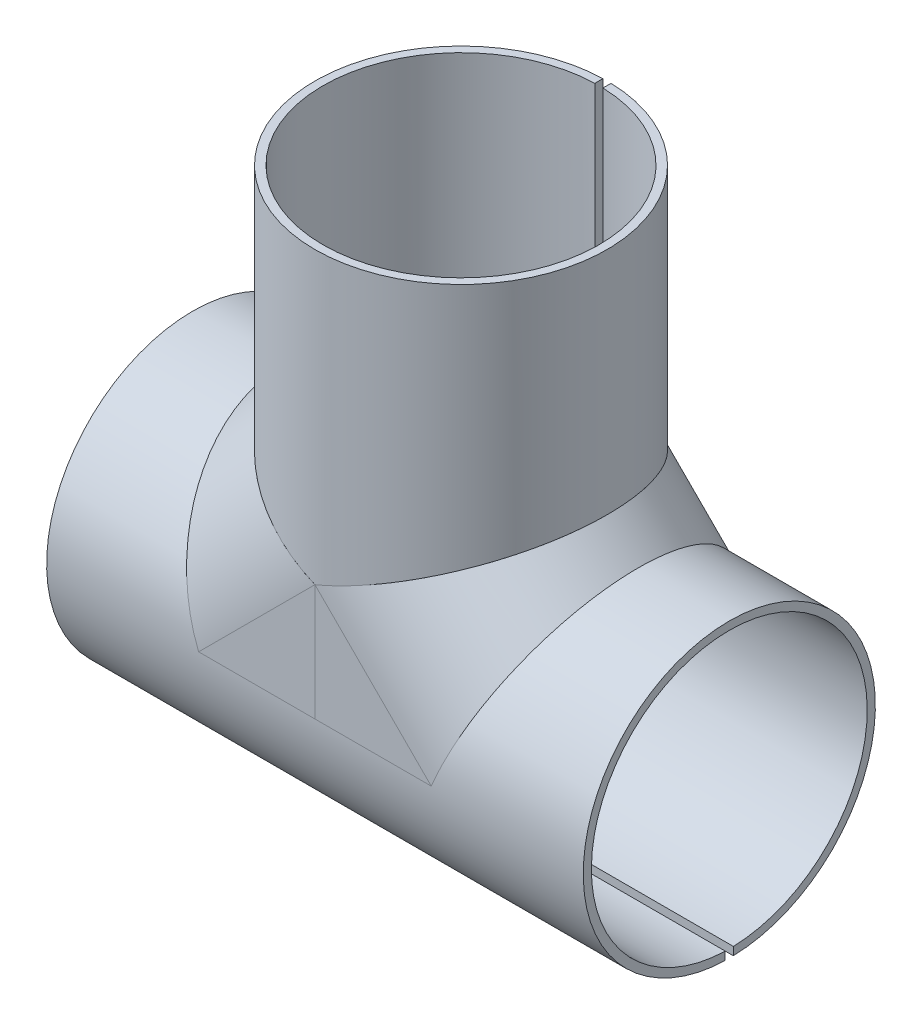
ISO-10303-21;
HEADER;
FILE_DESCRIPTION(('STEP AP214'),'2;1');
FILE_NAME('part.step','',(''),(''),'','','');
FILE_SCHEMA(('AUTOMOTIVE_DESIGN { 1 0 10303 214 1 1 1 1 }'));
ENDSEC;
DATA;
#1=APPLICATION_CONTEXT('core data for automotive mechanical design processes');
#2=APPLICATION_PROTOCOL_DEFINITION('international standard','automotive_design',2000,#1);
#3=PRODUCT_CONTEXT('',#1,'mechanical');
#4=PRODUCT('Part','Part','',(#3));
#5=PRODUCT_RELATED_PRODUCT_CATEGORY('part','',(#4));
#6=PRODUCT_DEFINITION_FORMATION('','',#4);
#7=PRODUCT_DEFINITION_CONTEXT('part definition',#1,'design');
#8=PRODUCT_DEFINITION('design','',#6,#7);
#9=PRODUCT_DEFINITION_SHAPE('','',#8);
#10=(LENGTH_UNIT() NAMED_UNIT(*) SI_UNIT(.MILLI.,.METRE.));
#11=(NAMED_UNIT(*) PLANE_ANGLE_UNIT() SI_UNIT($,.RADIAN.));
#12=(NAMED_UNIT(*) SI_UNIT($,.STERADIAN.) SOLID_ANGLE_UNIT());
#13=UNCERTAINTY_MEASURE_WITH_UNIT(LENGTH_MEASURE(1.E-05),#10,'distance_accuracy_value','');
#14=(GEOMETRIC_REPRESENTATION_CONTEXT(3) GLOBAL_UNCERTAINTY_ASSIGNED_CONTEXT((#13)) GLOBAL_UNIT_ASSIGNED_CONTEXT((#10,
#11,#12)) REPRESENTATION_CONTEXT('',''));
#15=CARTESIAN_POINT('',(0.,0.,0.));
#16=DIRECTION('',(0.,0.,1.));
#17=DIRECTION('',(1.,0.,0.));
#18=AXIS2_PLACEMENT_3D('',#15,#16,#17);
#19=CARTESIAN_POINT('',(-14.3061626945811,0.,0.));
#20=DIRECTION('',(0.707106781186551,0.707106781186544,0.));
#21=DIRECTION('',(-0.707106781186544,0.707106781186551,0.));
#22=AXIS2_PLACEMENT_3D('',#19,#20,#21);
#23=CYLINDRICAL_SURFACE('',#22,16.9630248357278);
#24=DIRECTION('',(0.707106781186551,0.707106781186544,0.));
#25=VECTOR('',#24,1.);
#26=CARTESIAN_POINT('',(-14.3061626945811,0.,16.9630248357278));
#27=LINE('',#26,#25);
#28=CARTESIAN_POINT('',(0.,14.3061626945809,16.9630248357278));
#29=VERTEX_POINT('',#28);
#30=CARTESIAN_POINT('',(-14.3061626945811,0.,16.9630248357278));
#31=VERTEX_POINT('',#30);
#32=EDGE_CURVE('E185',#29,#31,#27,.F.);
#33=ORIENTED_EDGE('',*,*,#32,.T.);
#34=CARTESIAN_POINT('',(-14.3061626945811,0.,0.));
#35=DIRECTION('',(-0.923879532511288,-0.382683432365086,0.));
#36=DIRECTION('',(-0.382683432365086,0.923879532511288,0.));
#37=AXIS2_PLACEMENT_3D('',#34,#35,#36);
#38=ELLIPSE('',#37,18.3606457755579,16.9630248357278);
#39=CARTESIAN_POINT('',(-14.3061626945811,0.,-16.9630248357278));
#40=VERTEX_POINT('',#39);
#41=EDGE_CURVE('E14',#31,#40,#38,.T.);
#42=ORIENTED_EDGE('',*,*,#41,.T.);
#43=DIRECTION('',(0.707106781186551,0.707106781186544,0.));
#44=VECTOR('',#43,1.);
#45=CARTESIAN_POINT('',(-14.3061626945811,0.,-16.9630248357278));
#46=LINE('',#45,#44);
#47=CARTESIAN_POINT('',(0.,14.3061626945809,-16.9630248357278));
#48=VERTEX_POINT('',#47);
#49=EDGE_CURVE('E83',#40,#48,#46,.T.);
#50=ORIENTED_EDGE('',*,*,#49,.T.);
#51=CARTESIAN_POINT('',(0.,14.3061626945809,0.));
#52=DIRECTION('',(0.382683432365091,0.923879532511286,0.));
#53=DIRECTION('',(0.923879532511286,-0.382683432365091,0.));
#54=AXIS2_PLACEMENT_3D('',#51,#52,#53);
#55=ELLIPSE('',#54,18.360645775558,16.9630248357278);
#56=EDGE_CURVE('E182',#48,#29,#55,.T.);
#57=ORIENTED_EDGE('',*,*,#56,.T.);
#58=EDGE_LOOP('',(#33,#42,#50,#57));
#59=FACE_BOUND('',#58,.T.);
#60=ADVANCED_FACE('F75',(#59),#23,.F.);
#61=CARTESIAN_POINT('',(-14.3061626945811,0.,-17.9630248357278));
#62=DIRECTION('',(-0.923879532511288,-0.382683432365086,0.));
#63=DIRECTION('',(0.382683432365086,-0.923879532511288,0.));
#64=AXIS2_PLACEMENT_3D('',#61,#62,#63);
#65=PLANE('',#64);
#66=CARTESIAN_POINT('',(-14.3061626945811,0.,0.));
#67=DIRECTION('',(-0.923879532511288,-0.382683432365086,0.));
#68=DIRECTION('',(-0.382683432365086,0.923879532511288,0.));
#69=AXIS2_PLACEMENT_3D('',#66,#67,#68);
#70=ELLIPSE('',#69,19.4430379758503,17.9630248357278);
#71=CARTESIAN_POINT('',(-14.3061626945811,0.,17.9630248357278));
#72=VERTEX_POINT('',#71);
#73=CARTESIAN_POINT('',(-14.3061626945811,0.,-17.9630248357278));
#74=VERTEX_POINT('',#73);
#75=EDGE_CURVE('E180',#72,#74,#70,.T.);
#76=ORIENTED_EDGE('',*,*,#75,.T.);
#77=DIRECTION('',(0.,0.,1.));
#78=VECTOR('',#77,1.);
#79=CARTESIAN_POINT('',(-14.3061626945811,0.,-17.9630248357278));
#80=LINE('',#79,#78);
#81=EDGE_CURVE('E98',#74,#40,#80,.T.);
#82=ORIENTED_EDGE('',*,*,#81,.T.);
#83=ORIENTED_EDGE('',*,*,#41,.F.);
#84=EDGE_CURVE('E176',#31,#72,#80,.T.);
#85=ORIENTED_EDGE('',*,*,#84,.T.);
#86=EDGE_LOOP('',(#76,#82,#83,#85));
#87=FACE_BOUND('',#86,.T.);
#88=ADVANCED_FACE('F189',(#87),#65,.T.);
#89=CARTESIAN_POINT('',(0.,14.3061626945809,-17.9630248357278));
#90=DIRECTION('',(0.382683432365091,0.923879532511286,0.));
#91=DIRECTION('',(-0.923879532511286,0.382683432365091,0.));
#92=AXIS2_PLACEMENT_3D('',#89,#90,#91);
#93=PLANE('',#92);
#94=CARTESIAN_POINT('',(0.,14.3061626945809,0.));
#95=DIRECTION('',(0.382683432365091,0.923879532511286,0.));
#96=DIRECTION('',(0.923879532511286,-0.382683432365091,0.));
#97=AXIS2_PLACEMENT_3D('',#94,#95,#96);
#98=ELLIPSE('',#97,19.4430379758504,17.9630248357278);
#99=CARTESIAN_POINT('',(0.,14.3061626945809,-17.9630248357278));
#100=VERTEX_POINT('',#99);
#101=CARTESIAN_POINT('',(0.,14.3061626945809,17.9630248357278));
#102=VERTEX_POINT('',#101);
#103=EDGE_CURVE('E175',#100,#102,#98,.T.);
#104=ORIENTED_EDGE('',*,*,#103,.T.);
#105=DIRECTION('',(0.,0.,1.));
#106=VECTOR('',#105,1.);
#107=CARTESIAN_POINT('',(0.,14.3061626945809,-17.9630248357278));
#108=LINE('',#107,#106);
#109=EDGE_CURVE('E173',#29,#102,#108,.T.);
#110=ORIENTED_EDGE('',*,*,#109,.F.);
#111=ORIENTED_EDGE('',*,*,#56,.F.);
#112=EDGE_CURVE('E150',#100,#48,#108,.T.);
#113=ORIENTED_EDGE('',*,*,#112,.F.);
#114=EDGE_LOOP('',(#104,#110,#111,#113));
#115=FACE_BOUND('',#114,.T.);
#116=ADVANCED_FACE('F203',(#115),#93,.T.);
#117=CARTESIAN_POINT('',(-14.3061626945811,0.,0.));
#118=DIRECTION('',(0.707106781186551,0.707106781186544,0.));
#119=DIRECTION('',(-0.707106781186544,0.707106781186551,0.));
#120=AXIS2_PLACEMENT_3D('',#117,#118,#119);
#121=CYLINDRICAL_SURFACE('',#120,17.9630248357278);
#122=ORIENTED_EDGE('',*,*,#75,.F.);
#123=DIRECTION('',(0.707106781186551,0.707106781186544,0.));
#124=VECTOR('',#123,1.);
#125=CARTESIAN_POINT('',(0.,14.3061626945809,17.9630248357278));
#126=LINE('',#125,#124);
#127=EDGE_CURVE('E167',#72,#102,#126,.T.);
#128=ORIENTED_EDGE('',*,*,#127,.T.);
#129=ORIENTED_EDGE('',*,*,#103,.F.);
#130=DIRECTION('',(0.707106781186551,0.707106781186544,0.));
#131=VECTOR('',#130,1.);
#132=CARTESIAN_POINT('',(0.,14.3061626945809,-17.9630248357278));
#133=LINE('',#132,#131);
#134=EDGE_CURVE('E170',#74,#100,#133,.T.);
#135=ORIENTED_EDGE('',*,*,#134,.F.);
#136=EDGE_LOOP('',(#122,#128,#129,#135));
#137=FACE_BOUND('',#136,.T.);
#138=ADVANCED_FACE('F77',(#137),#121,.T.);
#139=CARTESIAN_POINT('',(0.,0.,16.9630248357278));
#140=DIRECTION('',(1.,0.,0.));
#141=DIRECTION('',(0.,1.,0.));
#142=AXIS2_PLACEMENT_3D('',#139,#140,#141);
#143=PLANE('',#142);
#144=DIRECTION('',(0.,1.,0.));
#145=VECTOR('',#144,1.);
#146=CARTESIAN_POINT('',(0.,0.,17.9630248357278));
#147=LINE('',#146,#145);
#148=CARTESIAN_POINT('',(0.,0.,17.9630248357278));
#149=VERTEX_POINT('',#148);
#150=EDGE_CURVE('E90',#149,#102,#147,.T.);
#151=ORIENTED_EDGE('',*,*,#150,.F.);
#152=DIRECTION('',(0.,0.,1.));
#153=VECTOR('',#152,1.);
#154=CARTESIAN_POINT('',(0.,0.,16.9630248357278));
#155=LINE('',#154,#153);
#156=CARTESIAN_POINT('',(0.,0.,16.9630248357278));
#157=VERTEX_POINT('',#156);
#158=EDGE_CURVE('E163',#157,#149,#155,.T.);
#159=ORIENTED_EDGE('',*,*,#158,.F.);
#160=DIRECTION('',(0.,1.,0.));
#161=VECTOR('',#160,1.);
#162=CARTESIAN_POINT('',(0.,0.,16.9630248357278));
#163=LINE('',#162,#161);
#164=EDGE_CURVE('E156',#157,#29,#163,.T.);
#165=ORIENTED_EDGE('',*,*,#164,.T.);
#166=ORIENTED_EDGE('',*,*,#109,.T.);
#167=EDGE_LOOP('',(#151,#159,#165,#166));
#168=FACE_BOUND('',#167,.T.);
#169=ADVANCED_FACE('F201',(#168),#143,.T.);
#170=CARTESIAN_POINT('',(-14.3061626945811,0.,16.9630248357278));
#171=DIRECTION('',(0.,-1.,0.));
#172=DIRECTION('',(0.,0.,-1.));
#173=AXIS2_PLACEMENT_3D('',#170,#171,#172);
#174=PLANE('',#173);
#175=DIRECTION('',(1.,0.,0.));
#176=VECTOR('',#175,1.);
#177=CARTESIAN_POINT('',(-14.3061626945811,0.,17.9630248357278));
#178=LINE('',#177,#176);
#179=EDGE_CURVE('E160',#72,#149,#178,.T.);
#180=ORIENTED_EDGE('',*,*,#179,.F.);
#181=ORIENTED_EDGE('',*,*,#84,.F.);
#182=DIRECTION('',(1.,0.,0.));
#183=VECTOR('',#182,1.);
#184=CARTESIAN_POINT('',(-14.3061626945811,0.,16.9630248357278));
#185=LINE('',#184,#183);
#186=EDGE_CURVE('E159',#31,#157,#185,.T.);
#187=ORIENTED_EDGE('',*,*,#186,.T.);
#188=ORIENTED_EDGE('',*,*,#158,.T.);
#189=EDGE_LOOP('',(#180,#181,#187,#188));
#190=FACE_BOUND('',#189,.T.);
#191=ADVANCED_FACE('F195',(#190),#174,.T.);
#192=CARTESIAN_POINT('',(0.,0.,16.9630248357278));
#193=DIRECTION('',(0.,0.,-1.));
#194=DIRECTION('',(-1.,0.,0.));
#195=AXIS2_PLACEMENT_3D('',#192,#193,#194);
#196=PLANE('',#195);
#197=ORIENTED_EDGE('',*,*,#164,.F.);
#198=ORIENTED_EDGE('',*,*,#186,.F.);
#199=ORIENTED_EDGE('',*,*,#32,.F.);
#200=EDGE_LOOP('',(#197,#198,#199));
#201=FACE_BOUND('',#200,.T.);
#202=ADVANCED_FACE('F198',(#201),#196,.T.);
#203=CARTESIAN_POINT('',(0.,0.,17.9630248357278));
#204=DIRECTION('',(0.,0.,-1.));
#205=DIRECTION('',(-1.,0.,0.));
#206=AXIS2_PLACEMENT_3D('',#203,#204,#205);
#207=PLANE('',#206);
#208=ORIENTED_EDGE('',*,*,#150,.T.);
#209=ORIENTED_EDGE('',*,*,#127,.F.);
#210=ORIENTED_EDGE('',*,*,#179,.T.);
#211=EDGE_LOOP('',(#208,#209,#210));
#212=FACE_BOUND('',#211,.T.);
#213=ADVANCED_FACE('F205',(#212),#207,.F.);
#214=CARTESIAN_POINT('',(0.,0.,-16.9630248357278));
#215=DIRECTION('',(-1.,0.,0.));
#216=DIRECTION('',(0.,-1.,0.));
#217=AXIS2_PLACEMENT_3D('',#214,#215,#216);
#218=PLANE('',#217);
#219=DIRECTION('',(0.,1.,0.));
#220=VECTOR('',#219,1.);
#221=CARTESIAN_POINT('',(0.,0.,-17.9630248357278));
#222=LINE('',#221,#220);
#223=CARTESIAN_POINT('',(0.,0.,-17.9630248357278));
#224=VERTEX_POINT('',#223);
#225=EDGE_CURVE('E152',#224,#100,#222,.T.);
#226=ORIENTED_EDGE('',*,*,#225,.T.);
#227=ORIENTED_EDGE('',*,*,#112,.T.);
#228=DIRECTION('',(0.,1.,0.));
#229=VECTOR('',#228,1.);
#230=CARTESIAN_POINT('',(0.,0.,-16.9630248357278));
#231=LINE('',#230,#229);
#232=CARTESIAN_POINT('',(0.,0.,-16.9630248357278));
#233=VERTEX_POINT('',#232);
#234=EDGE_CURVE('E134',#233,#48,#231,.T.);
#235=ORIENTED_EDGE('',*,*,#234,.F.);
#236=DIRECTION('',(0.,0.,-1.));
#237=VECTOR('',#236,1.);
#238=CARTESIAN_POINT('',(0.,0.,-16.9630248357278));
#239=LINE('',#238,#237);
#240=EDGE_CURVE('E138',#233,#224,#239,.T.);
#241=ORIENTED_EDGE('',*,*,#240,.T.);
#242=EDGE_LOOP('',(#226,#227,#235,#241));
#243=FACE_BOUND('',#242,.T.);
#244=ADVANCED_FACE('F148',(#243),#218,.F.);
#245=CARTESIAN_POINT('',(-14.3061626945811,0.,-16.9630248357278));
#246=DIRECTION('',(0.,1.,0.));
#247=DIRECTION('',(0.,0.,1.));
#248=AXIS2_PLACEMENT_3D('',#245,#246,#247);
#249=PLANE('',#248);
#250=DIRECTION('',(1.,0.,0.));
#251=VECTOR('',#250,1.);
#252=CARTESIAN_POINT('',(-14.3061626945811,0.,-17.9630248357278));
#253=LINE('',#252,#251);
#254=EDGE_CURVE('E143',#74,#224,#253,.T.);
#255=ORIENTED_EDGE('',*,*,#254,.T.);
#256=ORIENTED_EDGE('',*,*,#240,.F.);
#257=DIRECTION('',(1.,0.,0.));
#258=VECTOR('',#257,1.);
#259=CARTESIAN_POINT('',(-14.3061626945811,0.,-16.9630248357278));
#260=LINE('',#259,#258);
#261=EDGE_CURVE('E130',#40,#233,#260,.T.);
#262=ORIENTED_EDGE('',*,*,#261,.F.);
#263=ORIENTED_EDGE('',*,*,#81,.F.);
#264=EDGE_LOOP('',(#255,#256,#262,#263));
#265=FACE_BOUND('',#264,.T.);
#266=ADVANCED_FACE('F141',(#265),#249,.F.);
#267=CARTESIAN_POINT('',(0.,0.,-16.9630248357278));
#268=DIRECTION('',(0.,0.,1.));
#269=DIRECTION('',(-1.,0.,0.));
#270=AXIS2_PLACEMENT_3D('',#267,#268,#269);
#271=PLANE('',#270);
#272=ORIENTED_EDGE('',*,*,#234,.T.);
#273=ORIENTED_EDGE('',*,*,#49,.F.);
#274=ORIENTED_EDGE('',*,*,#261,.T.);
#275=EDGE_LOOP('',(#272,#273,#274));
#276=FACE_BOUND('',#275,.T.);
#277=ADVANCED_FACE('F132',(#276),#271,.T.);
#278=CARTESIAN_POINT('',(0.,0.,-17.9630248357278));
#279=DIRECTION('',(0.,0.,1.));
#280=DIRECTION('',(-1.,0.,0.));
#281=AXIS2_PLACEMENT_3D('',#278,#279,#280);
#282=PLANE('',#281);
#283=ORIENTED_EDGE('',*,*,#225,.F.);
#284=ORIENTED_EDGE('',*,*,#254,.F.);
#285=ORIENTED_EDGE('',*,*,#134,.T.);
#286=EDGE_LOOP('',(#283,#284,#285));
#287=FACE_BOUND('',#286,.T.);
#288=ADVANCED_FACE('F284',(#287),#282,.F.);
#289=CLOSED_SHELL('',(#60,#88,#116,#138,#169,#191,#202,#213,#244,#266,#277,#288));
#290=MANIFOLD_SOLID_BREP('B2',#289);
#291=CARTESIAN_POINT('',(14.3061626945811,0.,0.));
#292=DIRECTION('',(-0.707106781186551,0.707106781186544,0.));
#293=DIRECTION('',(-0.707106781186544,-0.707106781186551,0.));
#294=AXIS2_PLACEMENT_3D('',#291,#292,#293);
#295=CYLINDRICAL_SURFACE('',#294,16.9630248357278);
#296=CARTESIAN_POINT('',(14.3061626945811,0.,0.));
#297=DIRECTION('',(0.923879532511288,-0.382683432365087,0.));
#298=DIRECTION('',(0.382683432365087,0.923879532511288,0.));
#299=AXIS2_PLACEMENT_3D('',#296,#297,#298);
#300=ELLIPSE('',#299,18.3606457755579,16.9630248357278);
#301=CARTESIAN_POINT('',(14.3061626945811,0.,16.9630248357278));
#302=VERTEX_POINT('',#301);
#303=CARTESIAN_POINT('',(14.3061626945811,0.,-16.9630248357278));
#304=VERTEX_POINT('',#303);
#305=EDGE_CURVE('E73',#302,#304,#300,.F.);
#306=ORIENTED_EDGE('',*,*,#305,.F.);
#307=DIRECTION('',(-0.707106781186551,0.707106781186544,0.));
#308=VECTOR('',#307,1.);
#309=CARTESIAN_POINT('',(14.3061626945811,0.,16.9630248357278));
#310=LINE('',#309,#308);
#311=CARTESIAN_POINT('',(0.,14.3061626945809,16.9630248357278));
#312=VERTEX_POINT('',#311);
#313=EDGE_CURVE('E323',#312,#302,#310,.F.);
#314=ORIENTED_EDGE('',*,*,#313,.F.);
#315=CARTESIAN_POINT('',(0.,14.3061626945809,0.));
#316=DIRECTION('',(-0.382683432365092,0.923879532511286,0.));
#317=DIRECTION('',(-0.923879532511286,-0.382683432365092,0.));
#318=AXIS2_PLACEMENT_3D('',#315,#316,#317);
#319=ELLIPSE('',#318,18.360645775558,16.9630248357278);
#320=CARTESIAN_POINT('',(0.,14.3061626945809,-16.9630248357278));
#321=VERTEX_POINT('',#320);
#322=EDGE_CURVE('E424',#321,#312,#319,.F.);
#323=ORIENTED_EDGE('',*,*,#322,.F.);
#324=DIRECTION('',(-0.707106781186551,0.707106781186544,0.));
#325=VECTOR('',#324,1.);
#326=CARTESIAN_POINT('',(14.3061626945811,0.,-16.9630248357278));
#327=LINE('',#326,#325);
#328=EDGE_CURVE('E378',#304,#321,#327,.T.);
#329=ORIENTED_EDGE('',*,*,#328,.F.);
#330=EDGE_LOOP('',(#306,#314,#323,#329));
#331=FACE_BOUND('',#330,.T.);
#332=ADVANCED_FACE('F315',(#331),#295,.F.);
#333=CARTESIAN_POINT('',(21.7466912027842,17.9630248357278,-17.9630248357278));
#334=DIRECTION('',(0.923879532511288,-0.382683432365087,0.));
#335=DIRECTION('',(0.382683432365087,0.923879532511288,0.));
#336=AXIS2_PLACEMENT_3D('',#333,#334,#335);
#337=PLANE('',#336);
#338=CARTESIAN_POINT('',(14.3061626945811,0.,0.));
#339=DIRECTION('',(0.923879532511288,-0.382683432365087,0.));
#340=DIRECTION('',(0.382683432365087,0.923879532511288,0.));
#341=AXIS2_PLACEMENT_3D('',#338,#339,#340);
#342=ELLIPSE('',#341,19.4430379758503,17.9630248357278);
#343=CARTESIAN_POINT('',(14.3061626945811,0.,17.9630248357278));
#344=VERTEX_POINT('',#343);
#345=CARTESIAN_POINT('',(14.3061626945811,0.,-17.9630248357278));
#346=VERTEX_POINT('',#345);
#347=EDGE_CURVE('E421',#344,#346,#342,.F.);
#348=ORIENTED_EDGE('',*,*,#347,.F.);
#349=DIRECTION('',(0.,0.,1.));
#350=VECTOR('',#349,1.);
#351=CARTESIAN_POINT('',(14.3061626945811,0.,-17.9630248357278));
#352=LINE('',#351,#350);
#353=EDGE_CURVE('E417',#302,#344,#352,.T.);
#354=ORIENTED_EDGE('',*,*,#353,.F.);
#355=ORIENTED_EDGE('',*,*,#305,.T.);
#356=EDGE_CURVE('E392',#346,#304,#352,.T.);
#357=ORIENTED_EDGE('',*,*,#356,.F.);
#358=EDGE_LOOP('',(#348,#354,#355,#357));
#359=FACE_BOUND('',#358,.T.);
#360=ADVANCED_FACE('F438',(#359),#337,.T.);
#361=CARTESIAN_POINT('',(17.9630248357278,21.7466912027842,-17.9630248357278));
#362=DIRECTION('',(-0.382683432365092,0.923879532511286,0.));
#363=DIRECTION('',(-0.923879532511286,-0.382683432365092,0.));
#364=AXIS2_PLACEMENT_3D('',#361,#362,#363);
#365=PLANE('',#364);
#366=DIRECTION('',(0.,0.,1.));
#367=VECTOR('',#366,1.);
#368=CARTESIAN_POINT('',(0.,14.3061626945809,-17.9630248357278));
#369=LINE('',#368,#367);
#370=CARTESIAN_POINT('',(0.,14.3061626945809,-17.9630248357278));
#371=VERTEX_POINT('',#370);
#372=EDGE_CURVE('E338',#371,#321,#369,.T.);
#373=ORIENTED_EDGE('',*,*,#372,.T.);
#374=ORIENTED_EDGE('',*,*,#322,.T.);
#375=CARTESIAN_POINT('',(0.,14.3061626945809,17.9630248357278));
#376=VERTEX_POINT('',#375);
#377=EDGE_CURVE('E414',#312,#376,#369,.T.);
#378=ORIENTED_EDGE('',*,*,#377,.T.);
#379=CARTESIAN_POINT('',(0.,14.3061626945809,0.));
#380=DIRECTION('',(-0.382683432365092,0.923879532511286,0.));
#381=DIRECTION('',(-0.923879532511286,-0.382683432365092,0.));
#382=AXIS2_PLACEMENT_3D('',#379,#380,#381);
#383=ELLIPSE('',#382,19.4430379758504,17.9630248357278);
#384=EDGE_CURVE('E416',#371,#376,#383,.F.);
#385=ORIENTED_EDGE('',*,*,#384,.F.);
#386=EDGE_LOOP('',(#373,#374,#378,#385));
#387=FACE_BOUND('',#386,.T.);
#388=ADVANCED_FACE('F440',(#387),#365,.T.);
#389=CARTESIAN_POINT('',(14.3061626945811,0.,0.));
#390=DIRECTION('',(-0.707106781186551,0.707106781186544,0.));
#391=DIRECTION('',(-0.707106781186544,-0.707106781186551,0.));
#392=AXIS2_PLACEMENT_3D('',#389,#390,#391);
#393=CYLINDRICAL_SURFACE('',#392,17.9630248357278);
#394=ORIENTED_EDGE('',*,*,#384,.T.);
#395=DIRECTION('',(0.707106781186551,-0.707106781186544,0.));
#396=VECTOR('',#395,1.);
#397=CARTESIAN_POINT('',(14.3061626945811,0.,17.9630248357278));
#398=LINE('',#397,#396);
#399=EDGE_CURVE('E408',#376,#344,#398,.T.);
#400=ORIENTED_EDGE('',*,*,#399,.T.);
#401=ORIENTED_EDGE('',*,*,#347,.T.);
#402=DIRECTION('',(0.707106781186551,-0.707106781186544,0.));
#403=VECTOR('',#402,1.);
#404=CARTESIAN_POINT('',(14.3061626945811,0.,-17.9630248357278));
#405=LINE('',#404,#403);
#406=EDGE_CURVE('E411',#371,#346,#405,.T.);
#407=ORIENTED_EDGE('',*,*,#406,.F.);
#408=EDGE_LOOP('',(#394,#400,#401,#407));
#409=FACE_BOUND('',#408,.T.);
#410=ADVANCED_FACE('F317',(#409),#393,.T.);
#411=CARTESIAN_POINT('',(0.,0.,16.9630248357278));
#412=DIRECTION('',(0.,-1.,0.));
#413=DIRECTION('',(0.,0.,-1.));
#414=AXIS2_PLACEMENT_3D('',#411,#412,#413);
#415=PLANE('',#414);
#416=DIRECTION('',(1.,0.,0.));
#417=VECTOR('',#416,1.);
#418=CARTESIAN_POINT('',(0.,0.,17.9630248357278));
#419=LINE('',#418,#417);
#420=CARTESIAN_POINT('',(0.,0.,17.9630248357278));
#421=VERTEX_POINT('',#420);
#422=EDGE_CURVE('E330',#421,#344,#419,.T.);
#423=ORIENTED_EDGE('',*,*,#422,.F.);
#424=DIRECTION('',(0.,0.,1.));
#425=VECTOR('',#424,1.);
#426=CARTESIAN_POINT('',(0.,0.,16.9630248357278));
#427=LINE('',#426,#425);
#428=CARTESIAN_POINT('',(0.,0.,16.9630248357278));
#429=VERTEX_POINT('',#428);
#430=EDGE_CURVE('E404',#429,#421,#427,.T.);
#431=ORIENTED_EDGE('',*,*,#430,.F.);
#432=DIRECTION('',(1.,0.,0.));
#433=VECTOR('',#432,1.);
#434=CARTESIAN_POINT('',(0.,0.,16.9630248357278));
#435=LINE('',#434,#433);
#436=EDGE_CURVE('E401',#429,#302,#435,.T.);
#437=ORIENTED_EDGE('',*,*,#436,.T.);
#438=ORIENTED_EDGE('',*,*,#353,.T.);
#439=EDGE_LOOP('',(#423,#431,#437,#438));
#440=FACE_BOUND('',#439,.T.);
#441=ADVANCED_FACE('F435',(#440),#415,.T.);
#442=CARTESIAN_POINT('',(0.,14.3061626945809,16.9630248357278));
#443=DIRECTION('',(-1.,0.,0.));
#444=DIRECTION('',(0.,-1.,0.));
#445=AXIS2_PLACEMENT_3D('',#442,#443,#444);
#446=PLANE('',#445);
#447=DIRECTION('',(0.,-1.,0.));
#448=VECTOR('',#447,1.);
#449=CARTESIAN_POINT('',(0.,14.3061626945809,17.9630248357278));
#450=LINE('',#449,#448);
#451=EDGE_CURVE('E389',#376,#421,#450,.T.);
#452=ORIENTED_EDGE('',*,*,#451,.F.);
#453=ORIENTED_EDGE('',*,*,#377,.F.);
#454=DIRECTION('',(0.,-1.,0.));
#455=VECTOR('',#454,1.);
#456=CARTESIAN_POINT('',(0.,14.3061626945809,16.9630248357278));
#457=LINE('',#456,#455);
#458=EDGE_CURVE('E398',#312,#429,#457,.T.);
#459=ORIENTED_EDGE('',*,*,#458,.T.);
#460=ORIENTED_EDGE('',*,*,#430,.T.);
#461=EDGE_LOOP('',(#452,#453,#459,#460));
#462=FACE_BOUND('',#461,.T.);
#463=ADVANCED_FACE('F443',(#462),#446,.T.);
#464=CARTESIAN_POINT('',(0.,14.3061626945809,16.9630248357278));
#465=DIRECTION('',(0.,0.,1.));
#466=DIRECTION('',(1.,0.,0.));
#467=AXIS2_PLACEMENT_3D('',#464,#465,#466);
#468=PLANE('',#467);
#469=ORIENTED_EDGE('',*,*,#313,.T.);
#470=ORIENTED_EDGE('',*,*,#436,.F.);
#471=ORIENTED_EDGE('',*,*,#458,.F.);
#472=EDGE_LOOP('',(#469,#470,#471));
#473=FACE_BOUND('',#472,.T.);
#474=ADVANCED_FACE('F430',(#473),#468,.F.);
#475=CARTESIAN_POINT('',(0.,14.3061626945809,17.9630248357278));
#476=DIRECTION('',(0.,0.,1.));
#477=DIRECTION('',(1.,0.,0.));
#478=AXIS2_PLACEMENT_3D('',#475,#476,#477);
#479=PLANE('',#478);
#480=ORIENTED_EDGE('',*,*,#399,.F.);
#481=ORIENTED_EDGE('',*,*,#451,.T.);
#482=ORIENTED_EDGE('',*,*,#422,.T.);
#483=EDGE_LOOP('',(#480,#481,#482));
#484=FACE_BOUND('',#483,.T.);
#485=ADVANCED_FACE('F444',(#484),#479,.T.);
#486=CARTESIAN_POINT('',(0.,14.3061626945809,-16.9630248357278));
#487=DIRECTION('',(1.,0.,0.));
#488=DIRECTION('',(0.,1.,0.));
#489=AXIS2_PLACEMENT_3D('',#486,#487,#488);
#490=PLANE('',#489);
#491=DIRECTION('',(0.,-1.,0.));
#492=VECTOR('',#491,1.);
#493=CARTESIAN_POINT('',(0.,14.3061626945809,-17.9630248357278));
#494=LINE('',#493,#492);
#495=CARTESIAN_POINT('',(0.,0.,-17.9630248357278));
#496=VERTEX_POINT('',#495);
#497=EDGE_CURVE('E385',#371,#496,#494,.T.);
#498=ORIENTED_EDGE('',*,*,#497,.T.);
#499=DIRECTION('',(0.,0.,-1.));
#500=VECTOR('',#499,1.);
#501=CARTESIAN_POINT('',(0.,0.,-16.9630248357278));
#502=LINE('',#501,#500);
#503=CARTESIAN_POINT('',(0.,0.,-16.9630248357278));
#504=VERTEX_POINT('',#503);
#505=EDGE_CURVE('E380',#504,#496,#502,.T.);
#506=ORIENTED_EDGE('',*,*,#505,.F.);
#507=DIRECTION('',(0.,-1.,0.));
#508=VECTOR('',#507,1.);
#509=CARTESIAN_POINT('',(0.,14.3061626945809,-16.9630248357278));
#510=LINE('',#509,#508);
#511=EDGE_CURVE('E371',#321,#504,#510,.T.);
#512=ORIENTED_EDGE('',*,*,#511,.F.);
#513=ORIENTED_EDGE('',*,*,#372,.F.);
#514=EDGE_LOOP('',(#498,#506,#512,#513));
#515=FACE_BOUND('',#514,.T.);
#516=ADVANCED_FACE('F383',(#515),#490,.F.);
#517=CARTESIAN_POINT('',(0.,0.,-16.9630248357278));
#518=DIRECTION('',(0.,1.,0.));
#519=DIRECTION('',(0.,0.,1.));
#520=AXIS2_PLACEMENT_3D('',#517,#518,#519);
#521=PLANE('',#520);
#522=DIRECTION('',(1.,0.,0.));
#523=VECTOR('',#522,1.);
#524=CARTESIAN_POINT('',(0.,0.,-17.9630248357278));
#525=LINE('',#524,#523);
#526=EDGE_CURVE('E394',#496,#346,#525,.T.);
#527=ORIENTED_EDGE('',*,*,#526,.T.);
#528=ORIENTED_EDGE('',*,*,#356,.T.);
#529=DIRECTION('',(1.,0.,0.));
#530=VECTOR('',#529,1.);
#531=CARTESIAN_POINT('',(0.,0.,-16.9630248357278));
#532=LINE('',#531,#530);
#533=EDGE_CURVE('E375',#504,#304,#532,.T.);
#534=ORIENTED_EDGE('',*,*,#533,.F.);
#535=ORIENTED_EDGE('',*,*,#505,.T.);
#536=EDGE_LOOP('',(#527,#528,#534,#535));
#537=FACE_BOUND('',#536,.T.);
#538=ADVANCED_FACE('F391',(#537),#521,.F.);
#539=CARTESIAN_POINT('',(0.,14.3061626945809,-16.9630248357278));
#540=DIRECTION('',(0.,0.,-1.));
#541=DIRECTION('',(1.,0.,0.));
#542=AXIS2_PLACEMENT_3D('',#539,#540,#541);
#543=PLANE('',#542);
#544=ORIENTED_EDGE('',*,*,#328,.T.);
#545=ORIENTED_EDGE('',*,*,#511,.T.);
#546=ORIENTED_EDGE('',*,*,#533,.T.);
#547=EDGE_LOOP('',(#544,#545,#546));
#548=FACE_BOUND('',#547,.T.);
#549=ADVANCED_FACE('F373',(#548),#543,.F.);
#550=CARTESIAN_POINT('',(0.,14.3061626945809,-17.9630248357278));
#551=DIRECTION('',(0.,0.,-1.));
#552=DIRECTION('',(1.,0.,0.));
#553=AXIS2_PLACEMENT_3D('',#550,#551,#552);
#554=PLANE('',#553);
#555=ORIENTED_EDGE('',*,*,#406,.T.);
#556=ORIENTED_EDGE('',*,*,#526,.F.);
#557=ORIENTED_EDGE('',*,*,#497,.F.);
#558=EDGE_LOOP('',(#555,#556,#557));
#559=FACE_BOUND('',#558,.T.);
#560=ADVANCED_FACE('F447',(#559),#554,.T.);
#561=CLOSED_SHELL('',(#332,#360,#388,#410,#441,#463,#474,#485,#516,#538,#549,#560));
#562=MANIFOLD_SOLID_BREP('B8',#561);
#563=CARTESIAN_POINT('',(33.,0.,0.));
#564=DIRECTION('',(-1.,0.,0.));
#565=DIRECTION('',(0.,0.,1.));
#566=AXIS2_PLACEMENT_3D('',#563,#564,#565);
#567=CYLINDRICAL_SURFACE('',#566,17.9630248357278);
#568=CARTESIAN_POINT('',(-14.3061626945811,0.,0.));
#569=DIRECTION('',(-0.923879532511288,-0.382683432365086,0.));
#570=DIRECTION('',(-0.382683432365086,0.923879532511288,0.));
#571=AXIS2_PLACEMENT_3D('',#568,#569,#570);
#572=ELLIPSE('',#571,19.4430379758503,17.9630248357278);
#573=CARTESIAN_POINT('',(-14.3061626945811,0.,17.9630248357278));
#574=VERTEX_POINT('',#573);
#575=CARTESIAN_POINT('',(-14.3061626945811,0.,-17.9630248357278));
#576=VERTEX_POINT('',#575);
#577=EDGE_CURVE('E685',#574,#576,#572,.T.);
#578=ORIENTED_EDGE('',*,*,#577,.T.);
#579=DIRECTION('',(1.,0.,0.));
#580=VECTOR('',#579,1.);
#581=CARTESIAN_POINT('',(-14.3061626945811,0.,-17.9630248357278));
#582=LINE('',#581,#580);
#583=CARTESIAN_POINT('',(14.3061626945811,0.,-17.9630248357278));
#584=VERTEX_POINT('',#583);
#585=EDGE_CURVE('E666',#576,#584,#582,.T.);
#586=ORIENTED_EDGE('',*,*,#585,.T.);
#587=CARTESIAN_POINT('',(14.3061626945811,0.,0.));
#588=DIRECTION('',(0.923879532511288,-0.382683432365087,0.));
#589=DIRECTION('',(-0.382683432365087,-0.923879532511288,0.));
#590=AXIS2_PLACEMENT_3D('',#587,#588,#589);
#591=ELLIPSE('',#590,19.4430379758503,17.9630248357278);
#592=CARTESIAN_POINT('',(14.3061626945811,0.,17.9630248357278));
#593=VERTEX_POINT('',#592);
#594=EDGE_CURVE('E667',#584,#593,#591,.T.);
#595=ORIENTED_EDGE('',*,*,#594,.T.);
#596=DIRECTION('',(1.,0.,0.));
#597=VECTOR('',#596,1.);
#598=CARTESIAN_POINT('',(-14.3061626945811,0.,17.9630248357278));
#599=LINE('',#598,#597);
#600=EDGE_CURVE('E680',#574,#593,#599,.T.);
#601=ORIENTED_EDGE('',*,*,#600,.F.);
#602=EDGE_LOOP('',(#578,#586,#595,#601));
#603=FACE_BOUND('',#602,.T.);
#604=CARTESIAN_POINT('',(-33.,0.,0.));
#605=DIRECTION('',(1.,0.,0.));
#606=DIRECTION('',(0.,0.,-1.));
#607=AXIS2_PLACEMENT_3D('',#604,#605,#606);
#608=CIRCLE('',#607,17.9630248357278);
#609=CARTESIAN_POINT('',(-33.,-17.9560647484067,-0.5));
#610=VERTEX_POINT('',#609);
#611=CARTESIAN_POINT('',(-33.,-17.9560647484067,0.5));
#612=VERTEX_POINT('',#611);
#613=EDGE_CURVE('E639',#610,#612,#608,.T.);
#614=ORIENTED_EDGE('',*,*,#613,.T.);
#615=DIRECTION('',(-1.,0.,0.));
#616=VECTOR('',#615,1.);
#617=CARTESIAN_POINT('',(33.,-17.9560647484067,0.5));
#618=LINE('',#617,#616);
#619=CARTESIAN_POINT('',(33.,-17.9560647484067,0.5));
#620=VERTEX_POINT('',#619);
#621=EDGE_CURVE('E568',#612,#620,#618,.F.);
#622=ORIENTED_EDGE('',*,*,#621,.T.);
#623=CARTESIAN_POINT('',(33.,0.,0.));
#624=DIRECTION('',(1.,0.,0.));
#625=DIRECTION('',(0.,0.,-1.));
#626=AXIS2_PLACEMENT_3D('',#623,#624,#625);
#627=CIRCLE('',#626,17.9630248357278);
#628=CARTESIAN_POINT('',(33.,-17.9560647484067,-0.5));
#629=VERTEX_POINT('',#628);
#630=EDGE_CURVE('E630',#629,#620,#627,.T.);
#631=ORIENTED_EDGE('',*,*,#630,.F.);
#632=DIRECTION('',(-1.,0.,0.));
#633=VECTOR('',#632,1.);
#634=CARTESIAN_POINT('',(33.,-17.9560647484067,-0.5));
#635=LINE('',#634,#633);
#636=EDGE_CURVE('E615',#610,#629,#635,.F.);
#637=ORIENTED_EDGE('',*,*,#636,.F.);
#638=EDGE_LOOP('',(#614,#622,#631,#637));
#639=FACE_BOUND('',#638,.T.);
#640=ADVANCED_FACE('F554',(#603,#639),#567,.T.);
#641=CARTESIAN_POINT('',(33.,0.,0.));
#642=DIRECTION('',(1.,0.,0.));
#643=DIRECTION('',(0.,0.,-1.));
#644=AXIS2_PLACEMENT_3D('',#641,#642,#643);
#645=PLANE('',#644);
#646=DIRECTION('',(0.,1.,0.));
#647=VECTOR('',#646,1.);
#648=CARTESIAN_POINT('',(33.,-17.9630248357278,0.5));
#649=LINE('',#648,#647);
#650=CARTESIAN_POINT('',(33.,-16.9556542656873,0.5));
#651=VERTEX_POINT('',#650);
#652=EDGE_CURVE('E633',#620,#651,#649,.T.);
#653=ORIENTED_EDGE('',*,*,#652,.T.);
#654=CARTESIAN_POINT('',(33.,0.,0.));
#655=DIRECTION('',(1.,0.,0.));
#656=DIRECTION('',(0.,0.,-1.));
#657=AXIS2_PLACEMENT_3D('',#654,#655,#656);
#658=CIRCLE('',#657,16.9630248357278);
#659=CARTESIAN_POINT('',(33.,-16.9556542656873,-0.5));
#660=VERTEX_POINT('',#659);
#661=EDGE_CURVE('E632',#660,#651,#658,.T.);
#662=ORIENTED_EDGE('',*,*,#661,.F.);
#663=DIRECTION('',(0.,1.,0.));
#664=VECTOR('',#663,1.);
#665=CARTESIAN_POINT('',(33.,-17.9630248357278,-0.5));
#666=LINE('',#665,#664);
#667=EDGE_CURVE('E618',#629,#660,#666,.T.);
#668=ORIENTED_EDGE('',*,*,#667,.F.);
#669=ORIENTED_EDGE('',*,*,#630,.T.);
#670=EDGE_LOOP('',(#653,#662,#668,#669));
#671=FACE_BOUND('',#670,.T.);
#672=ADVANCED_FACE('F629',(#671),#645,.T.);
#673=CARTESIAN_POINT('',(33.,0.,0.));
#674=DIRECTION('',(-1.,0.,0.));
#675=DIRECTION('',(0.,0.,1.));
#676=AXIS2_PLACEMENT_3D('',#673,#674,#675);
#677=CYLINDRICAL_SURFACE('',#676,16.9630248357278);
#678=DIRECTION('',(-1.,0.,0.));
#679=VECTOR('',#678,1.);
#680=CARTESIAN_POINT('',(33.,-16.9556542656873,0.5));
#681=LINE('',#680,#679);
#682=CARTESIAN_POINT('',(-33.,-16.9556542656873,0.5));
#683=VERTEX_POINT('',#682);
#684=EDGE_CURVE('E623',#683,#651,#681,.F.);
#685=ORIENTED_EDGE('',*,*,#684,.F.);
#686=CARTESIAN_POINT('',(-33.,0.,0.));
#687=DIRECTION('',(1.,0.,0.));
#688=DIRECTION('',(0.,0.,-1.));
#689=AXIS2_PLACEMENT_3D('',#686,#687,#688);
#690=CIRCLE('',#689,16.9630248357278);
#691=CARTESIAN_POINT('',(-33.,-16.9556542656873,-0.5));
#692=VERTEX_POINT('',#691);
#693=EDGE_CURVE('E687',#692,#683,#690,.T.);
#694=ORIENTED_EDGE('',*,*,#693,.F.);
#695=DIRECTION('',(-1.,0.,0.));
#696=VECTOR('',#695,1.);
#697=CARTESIAN_POINT('',(33.,-16.9556542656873,-0.5));
#698=LINE('',#697,#696);
#699=EDGE_CURVE('E575',#692,#660,#698,.F.);
#700=ORIENTED_EDGE('',*,*,#699,.T.);
#701=ORIENTED_EDGE('',*,*,#661,.T.);
#702=EDGE_LOOP('',(#685,#694,#700,#701));
#703=FACE_BOUND('',#702,.T.);
#704=CARTESIAN_POINT('',(-14.3061626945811,0.,0.));
#705=DIRECTION('',(-0.923879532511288,-0.382683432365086,0.));
#706=DIRECTION('',(-0.382683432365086,0.923879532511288,0.));
#707=AXIS2_PLACEMENT_3D('',#704,#705,#706);
#708=ELLIPSE('',#707,18.3606457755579,16.9630248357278);
#709=CARTESIAN_POINT('',(-14.3061626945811,0.,16.9630248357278));
#710=VERTEX_POINT('',#709);
#711=CARTESIAN_POINT('',(-14.3061626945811,0.,-16.9630248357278));
#712=VERTEX_POINT('',#711);
#713=EDGE_CURVE('E647',#710,#712,#708,.T.);
#714=ORIENTED_EDGE('',*,*,#713,.F.);
#715=DIRECTION('',(-1.,0.,0.));
#716=VECTOR('',#715,1.);
#717=CARTESIAN_POINT('',(33.,0.,16.9630248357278));
#718=LINE('',#717,#716);
#719=CARTESIAN_POINT('',(14.3061626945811,0.,16.9630248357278));
#720=VERTEX_POINT('',#719);
#721=EDGE_CURVE('E645',#720,#710,#718,.T.);
#722=ORIENTED_EDGE('',*,*,#721,.F.);
#723=CARTESIAN_POINT('',(14.3061626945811,0.,0.));
#724=DIRECTION('',(0.923879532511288,-0.382683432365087,0.));
#725=DIRECTION('',(-0.382683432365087,-0.923879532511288,0.));
#726=AXIS2_PLACEMENT_3D('',#723,#724,#725);
#727=ELLIPSE('',#726,18.3606457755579,16.9630248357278);
#728=CARTESIAN_POINT('',(14.3061626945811,0.,-16.9630248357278));
#729=VERTEX_POINT('',#728);
#730=EDGE_CURVE('E635',#729,#720,#727,.T.);
#731=ORIENTED_EDGE('',*,*,#730,.F.);
#732=DIRECTION('',(-1.,0.,0.));
#733=VECTOR('',#732,1.);
#734=CARTESIAN_POINT('',(33.,0.,-16.9630248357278));
#735=LINE('',#734,#733);
#736=EDGE_CURVE('E637',#712,#729,#735,.F.);
#737=ORIENTED_EDGE('',*,*,#736,.F.);
#738=EDGE_LOOP('',(#714,#722,#731,#737));
#739=FACE_BOUND('',#738,.T.);
#740=ADVANCED_FACE('F669',(#703,#739),#677,.F.);
#741=CARTESIAN_POINT('',(-33.,0.,0.));
#742=DIRECTION('',(1.,0.,0.));
#743=DIRECTION('',(0.,0.,-1.));
#744=AXIS2_PLACEMENT_3D('',#741,#742,#743);
#745=PLANE('',#744);
#746=ORIENTED_EDGE('',*,*,#693,.T.);
#747=DIRECTION('',(0.,-1.,0.));
#748=VECTOR('',#747,1.);
#749=CARTESIAN_POINT('',(-33.,0.,0.5));
#750=LINE('',#749,#748);
#751=EDGE_CURVE('E313',#683,#612,#750,.T.);
#752=ORIENTED_EDGE('',*,*,#751,.T.);
#753=ORIENTED_EDGE('',*,*,#613,.F.);
#754=DIRECTION('',(0.,-1.,0.));
#755=VECTOR('',#754,1.);
#756=CARTESIAN_POINT('',(-33.,0.,-0.5));
#757=LINE('',#756,#755);
#758=EDGE_CURVE('E561',#692,#610,#757,.T.);
#759=ORIENTED_EDGE('',*,*,#758,.F.);
#760=EDGE_LOOP('',(#746,#752,#753,#759));
#761=FACE_BOUND('',#760,.T.);
#762=ADVANCED_FACE('F690',(#761),#745,.F.);
#763=CARTESIAN_POINT('',(-14.3061626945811,0.,-17.9630248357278));
#764=DIRECTION('',(0.,-1.,0.));
#765=DIRECTION('',(0.,0.,-1.));
#766=AXIS2_PLACEMENT_3D('',#763,#764,#765);
#767=PLANE('',#766);
#768=ORIENTED_EDGE('',*,*,#721,.T.);
#769=DIRECTION('',(0.,0.,1.));
#770=VECTOR('',#769,1.);
#771=CARTESIAN_POINT('',(-14.3061626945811,0.,-17.9630248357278));
#772=LINE('',#771,#770);
#773=EDGE_CURVE('E657',#710,#574,#772,.T.);
#774=ORIENTED_EDGE('',*,*,#773,.T.);
#775=ORIENTED_EDGE('',*,*,#600,.T.);
#776=DIRECTION('',(0.,0.,1.));
#777=VECTOR('',#776,1.);
#778=CARTESIAN_POINT('',(14.3061626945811,0.,-17.9630248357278));
#779=LINE('',#778,#777);
#780=EDGE_CURVE('E674',#720,#593,#779,.T.);
#781=ORIENTED_EDGE('',*,*,#780,.F.);
#782=EDGE_LOOP('',(#768,#774,#775,#781));
#783=FACE_BOUND('',#782,.T.);
#784=ADVANCED_FACE('F678',(#783),#767,.F.);
#785=CARTESIAN_POINT('',(-14.3061626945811,0.,-17.9630248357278));
#786=DIRECTION('',(-0.923879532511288,-0.382683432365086,0.));
#787=DIRECTION('',(0.382683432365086,-0.923879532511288,0.));
#788=AXIS2_PLACEMENT_3D('',#785,#786,#787);
#789=PLANE('',#788);
#790=ORIENTED_EDGE('',*,*,#577,.F.);
#791=ORIENTED_EDGE('',*,*,#773,.F.);
#792=ORIENTED_EDGE('',*,*,#713,.T.);
#793=EDGE_CURVE('E655',#576,#712,#772,.T.);
#794=ORIENTED_EDGE('',*,*,#793,.F.);
#795=EDGE_LOOP('',(#790,#791,#792,#794));
#796=FACE_BOUND('',#795,.T.);
#797=ADVANCED_FACE('F654',(#796),#789,.F.);
#798=CARTESIAN_POINT('',(21.7466912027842,17.9630248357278,-17.9630248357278));
#799=DIRECTION('',(0.923879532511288,-0.382683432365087,0.));
#800=DIRECTION('',(0.382683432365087,0.923879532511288,0.));
#801=AXIS2_PLACEMENT_3D('',#798,#799,#800);
#802=PLANE('',#801);
#803=EDGE_CURVE('E676',#584,#729,#779,.T.);
#804=ORIENTED_EDGE('',*,*,#803,.T.);
#805=ORIENTED_EDGE('',*,*,#730,.T.);
#806=ORIENTED_EDGE('',*,*,#780,.T.);
#807=ORIENTED_EDGE('',*,*,#594,.F.);
#808=EDGE_LOOP('',(#804,#805,#806,#807));
#809=FACE_BOUND('',#808,.T.);
#810=ADVANCED_FACE('F673',(#809),#802,.F.);
#811=ORIENTED_EDGE('',*,*,#736,.T.);
#812=ORIENTED_EDGE('',*,*,#803,.F.);
#813=ORIENTED_EDGE('',*,*,#585,.F.);
#814=ORIENTED_EDGE('',*,*,#793,.T.);
#815=EDGE_LOOP('',(#811,#812,#813,#814));
#816=FACE_BOUND('',#815,.T.);
#817=ADVANCED_FACE('F662',(#816),#767,.F.);
#818=CARTESIAN_POINT('',(-33.,-17.9630248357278,-0.5));
#819=DIRECTION('',(0.,0.,1.));
#820=DIRECTION('',(1.,0.,0.));
#821=AXIS2_PLACEMENT_3D('',#818,#819,#820);
#822=PLANE('',#821);
#823=ORIENTED_EDGE('',*,*,#636,.T.);
#824=ORIENTED_EDGE('',*,*,#667,.T.);
#825=ORIENTED_EDGE('',*,*,#699,.F.);
#826=ORIENTED_EDGE('',*,*,#758,.T.);
#827=EDGE_LOOP('',(#823,#824,#825,#826));
#828=FACE_BOUND('',#827,.T.);
#829=ADVANCED_FACE('F617',(#828),#822,.T.);
#830=CARTESIAN_POINT('',(-33.,-17.9630248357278,0.5));
#831=DIRECTION('',(0.,0.,1.));
#832=DIRECTION('',(1.,0.,0.));
#833=AXIS2_PLACEMENT_3D('',#830,#831,#832);
#834=PLANE('',#833);
#835=ORIENTED_EDGE('',*,*,#751,.F.);
#836=ORIENTED_EDGE('',*,*,#684,.T.);
#837=ORIENTED_EDGE('',*,*,#652,.F.);
#838=ORIENTED_EDGE('',*,*,#621,.F.);
#839=EDGE_LOOP('',(#835,#836,#837,#838));
#840=FACE_BOUND('',#839,.T.);
#841=ADVANCED_FACE('F693',(#840),#834,.F.);
#842=CLOSED_SHELL('',(#640,#672,#740,#762,#784,#797,#810,#817,#829,#841));
#843=MANIFOLD_SOLID_BREP('B67',#842);
#844=CARTESIAN_POINT('',(0.,50.,0.));
#845=DIRECTION('',(0.,-1.,0.));
#846=DIRECTION('',(0.,0.,-1.));
#847=AXIS2_PLACEMENT_3D('',#844,#845,#846);
#848=CYLINDRICAL_SURFACE('',#847,17.9630248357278);
#849=CARTESIAN_POINT('',(0.,14.3061626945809,0.));
#850=DIRECTION('',(0.382683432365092,-0.923879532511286,0.));
#851=DIRECTION('',(-0.923879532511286,-0.382683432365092,0.));
#852=AXIS2_PLACEMENT_3D('',#849,#850,#851);
#853=ELLIPSE('',#852,19.4430379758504,17.9630248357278);
#854=CARTESIAN_POINT('',(0.5,14.5132694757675,-17.9560647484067));
#855=VERTEX_POINT('',#854);
#856=CARTESIAN_POINT('',(0.,14.3061626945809,17.9630248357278));
#857=VERTEX_POINT('',#856);
#858=EDGE_CURVE('E849',#855,#857,#853,.T.);
#859=ORIENTED_EDGE('',*,*,#858,.F.);
#860=DIRECTION('',(0.,-1.,0.));
#861=VECTOR('',#860,1.);
#862=CARTESIAN_POINT('',(0.5,50.,-17.9560647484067));
#863=LINE('',#862,#861);
#864=CARTESIAN_POINT('',(0.5,50.,-17.9560647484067));
#865=VERTEX_POINT('',#864);
#866=EDGE_CURVE('E794',#855,#865,#863,.F.);
#867=ORIENTED_EDGE('',*,*,#866,.T.);
#868=CARTESIAN_POINT('',(0.,50.,0.));
#869=DIRECTION('',(0.,1.,0.));
#870=DIRECTION('',(0.,0.,1.));
#871=AXIS2_PLACEMENT_3D('',#868,#869,#870);
#872=CIRCLE('',#871,17.9630248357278);
#873=CARTESIAN_POINT('',(-0.5,50.,-17.9560647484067));
#874=VERTEX_POINT('',#873);
#875=EDGE_CURVE('E838',#874,#865,#872,.T.);
#876=ORIENTED_EDGE('',*,*,#875,.F.);
#877=DIRECTION('',(0.,-1.,0.));
#878=VECTOR('',#877,1.);
#879=CARTESIAN_POINT('',(-0.5,50.,-17.9560647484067));
#880=LINE('',#879,#878);
#881=CARTESIAN_POINT('',(-0.5,14.5132694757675,-17.9560647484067));
#882=VERTEX_POINT('',#881);
#883=EDGE_CURVE('E824',#882,#874,#880,.F.);
#884=ORIENTED_EDGE('',*,*,#883,.F.);
#885=CARTESIAN_POINT('',(0.,14.306162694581,0.));
#886=DIRECTION('',(-0.382683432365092,-0.923879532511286,0.));
#887=DIRECTION('',(0.923879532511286,-0.382683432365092,0.));
#888=AXIS2_PLACEMENT_3D('',#885,#886,#887);
#889=ELLIPSE('',#888,19.4430379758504,17.9630248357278);
#890=EDGE_CURVE('E858',#857,#882,#889,.T.);
#891=ORIENTED_EDGE('',*,*,#890,.F.);
#892=EDGE_LOOP('',(#859,#867,#876,#884,#891));
#893=FACE_BOUND('',#892,.T.);
#894=ADVANCED_FACE('F781',(#893),#848,.T.);
#895=CARTESIAN_POINT('',(-17.9630248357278,21.7466912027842,-17.9630248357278));
#896=DIRECTION('',(-0.382683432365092,-0.923879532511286,0.));
#897=DIRECTION('',(0.923879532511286,-0.382683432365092,0.));
#898=AXIS2_PLACEMENT_3D('',#895,#896,#897);
#899=PLANE('',#898);
#900=ORIENTED_EDGE('',*,*,#890,.T.);
#901=DIRECTION('',(0.,0.,1.));
#902=VECTOR('',#901,1.);
#903=CARTESIAN_POINT('',(-0.5,14.5132694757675,-17.9630248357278));
#904=LINE('',#903,#902);
#905=CARTESIAN_POINT('',(-0.5,14.5132694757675,-16.9556542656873));
#906=VERTEX_POINT('',#905);
#907=EDGE_CURVE('E788',#882,#906,#904,.T.);
#908=ORIENTED_EDGE('',*,*,#907,.T.);
#909=CARTESIAN_POINT('',(0.,14.306162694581,0.));
#910=DIRECTION('',(-0.382683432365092,-0.923879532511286,0.));
#911=DIRECTION('',(0.923879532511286,-0.382683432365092,0.));
#912=AXIS2_PLACEMENT_3D('',#909,#910,#911);
#913=ELLIPSE('',#912,18.360645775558,16.9630248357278);
#914=CARTESIAN_POINT('',(0.,14.3061626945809,16.9630248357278));
#915=VERTEX_POINT('',#914);
#916=EDGE_CURVE('E844',#915,#906,#913,.T.);
#917=ORIENTED_EDGE('',*,*,#916,.F.);
#918=DIRECTION('',(0.,0.,1.));
#919=VECTOR('',#918,1.);
#920=CARTESIAN_POINT('',(0.,14.3061626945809,-17.9630248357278));
#921=LINE('',#920,#919);
#922=EDGE_CURVE('E866',#915,#857,#921,.T.);
#923=ORIENTED_EDGE('',*,*,#922,.T.);
#924=EDGE_LOOP('',(#900,#908,#917,#923));
#925=FACE_BOUND('',#924,.T.);
#926=ADVANCED_FACE('F855',(#925),#899,.T.);
#927=CARTESIAN_POINT('',(0.,50.,0.));
#928=DIRECTION('',(0.,-1.,0.));
#929=DIRECTION('',(0.,0.,-1.));
#930=AXIS2_PLACEMENT_3D('',#927,#928,#929);
#931=CYLINDRICAL_SURFACE('',#930,16.9630248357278);
#932=DIRECTION('',(0.,-1.,0.));
#933=VECTOR('',#932,1.);
#934=CARTESIAN_POINT('',(0.5,50.,-16.9556542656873));
#935=LINE('',#934,#933);
#936=CARTESIAN_POINT('',(0.5,14.5132694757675,-16.9556542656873));
#937=VERTEX_POINT('',#936);
#938=CARTESIAN_POINT('',(0.5,50.,-16.9556542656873));
#939=VERTEX_POINT('',#938);
#940=EDGE_CURVE('E863',#937,#939,#935,.F.);
#941=ORIENTED_EDGE('',*,*,#940,.F.);
#942=CARTESIAN_POINT('',(0.,14.3061626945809,0.));
#943=DIRECTION('',(0.382683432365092,-0.923879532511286,0.));
#944=DIRECTION('',(-0.923879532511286,-0.382683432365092,0.));
#945=AXIS2_PLACEMENT_3D('',#942,#943,#944);
#946=ELLIPSE('',#945,18.360645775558,16.9630248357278);
#947=EDGE_CURVE('E847',#937,#915,#946,.T.);
#948=ORIENTED_EDGE('',*,*,#947,.T.);
#949=ORIENTED_EDGE('',*,*,#916,.T.);
#950=DIRECTION('',(0.,-1.,0.));
#951=VECTOR('',#950,1.);
#952=CARTESIAN_POINT('',(-0.5,50.,-16.9556542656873));
#953=LINE('',#952,#951);
#954=CARTESIAN_POINT('',(-0.5,50.,-16.9556542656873));
#955=VERTEX_POINT('',#954);
#956=EDGE_CURVE('E802',#906,#955,#953,.F.);
#957=ORIENTED_EDGE('',*,*,#956,.T.);
#958=CARTESIAN_POINT('',(0.,50.,0.));
#959=DIRECTION('',(0.,1.,0.));
#960=DIRECTION('',(1.,0.,0.));
#961=AXIS2_PLACEMENT_3D('',#958,#959,#960);
#962=CIRCLE('',#961,16.9630248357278);
#963=EDGE_CURVE('E840',#955,#939,#962,.T.);
#964=ORIENTED_EDGE('',*,*,#963,.T.);
#965=EDGE_LOOP('',(#941,#948,#949,#957,#964));
#966=FACE_BOUND('',#965,.T.);
#967=ADVANCED_FACE('F861',(#966),#931,.F.);
#968=CARTESIAN_POINT('',(0.,50.,0.));
#969=DIRECTION('',(0.,1.,0.));
#970=DIRECTION('',(0.,0.,1.));
#971=AXIS2_PLACEMENT_3D('',#968,#969,#970);
#972=PLANE('',#971);
#973=DIRECTION('',(0.,0.,1.));
#974=VECTOR('',#973,1.);
#975=CARTESIAN_POINT('',(0.5,50.,-17.9630248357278));
#976=LINE('',#975,#974);
#977=EDGE_CURVE('E841',#865,#939,#976,.T.);
#978=ORIENTED_EDGE('',*,*,#977,.T.);
#979=ORIENTED_EDGE('',*,*,#963,.F.);
#980=DIRECTION('',(0.,0.,1.));
#981=VECTOR('',#980,1.);
#982=CARTESIAN_POINT('',(-0.5,50.,-17.9630248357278));
#983=LINE('',#982,#981);
#984=EDGE_CURVE('E827',#874,#955,#983,.T.);
#985=ORIENTED_EDGE('',*,*,#984,.F.);
#986=ORIENTED_EDGE('',*,*,#875,.T.);
#987=EDGE_LOOP('',(#978,#979,#985,#986));
#988=FACE_BOUND('',#987,.T.);
#989=ADVANCED_FACE('F837',(#988),#972,.T.);
#990=CARTESIAN_POINT('',(0.,14.3061626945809,-17.9630248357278));
#991=DIRECTION('',(0.382683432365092,-0.923879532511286,0.));
#992=DIRECTION('',(0.923879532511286,0.382683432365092,0.));
#993=AXIS2_PLACEMENT_3D('',#990,#991,#992);
#994=PLANE('',#993);
#995=DIRECTION('',(0.,0.,1.));
#996=VECTOR('',#995,1.);
#997=CARTESIAN_POINT('',(0.5,14.5132694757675,-17.9630248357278));
#998=LINE('',#997,#996);
#999=EDGE_CURVE('E552',#855,#937,#998,.T.);
#1000=ORIENTED_EDGE('',*,*,#999,.F.);
#1001=ORIENTED_EDGE('',*,*,#858,.T.);
#1002=ORIENTED_EDGE('',*,*,#922,.F.);
#1003=ORIENTED_EDGE('',*,*,#947,.F.);
#1004=EDGE_LOOP('',(#1000,#1001,#1002,#1003));
#1005=FACE_BOUND('',#1004,.T.);
#1006=ADVANCED_FACE('F865',(#1005),#994,.T.);
#1007=CARTESIAN_POINT('',(-0.5,0.,-17.9630248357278));
#1008=DIRECTION('',(1.,0.,0.));
#1009=DIRECTION('',(0.,0.,-1.));
#1010=AXIS2_PLACEMENT_3D('',#1007,#1008,#1009);
#1011=PLANE('',#1010);
#1012=ORIENTED_EDGE('',*,*,#907,.F.);
#1013=ORIENTED_EDGE('',*,*,#883,.T.);
#1014=ORIENTED_EDGE('',*,*,#984,.T.);
#1015=ORIENTED_EDGE('',*,*,#956,.F.);
#1016=EDGE_LOOP('',(#1012,#1013,#1014,#1015));
#1017=FACE_BOUND('',#1016,.T.);
#1018=ADVANCED_FACE('F826',(#1017),#1011,.T.);
#1019=CARTESIAN_POINT('',(0.5,0.,-17.9630248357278));
#1020=DIRECTION('',(1.,0.,0.));
#1021=DIRECTION('',(0.,0.,-1.));
#1022=AXIS2_PLACEMENT_3D('',#1019,#1020,#1021);
#1023=PLANE('',#1022);
#1024=ORIENTED_EDGE('',*,*,#940,.T.);
#1025=ORIENTED_EDGE('',*,*,#977,.F.);
#1026=ORIENTED_EDGE('',*,*,#866,.F.);
#1027=ORIENTED_EDGE('',*,*,#999,.T.);
#1028=EDGE_LOOP('',(#1024,#1025,#1026,#1027));
#1029=FACE_BOUND('',#1028,.T.);
#1030=ADVANCED_FACE('F873',(#1029),#1023,.F.);
#1031=CLOSED_SHELL('',(#894,#926,#967,#989,#1006,#1018,#1030));
#1032=MANIFOLD_SOLID_BREP('B307',#1031);
#1033=ADVANCED_BREP_SHAPE_REPRESENTATION('',(#18,#290,#562,#843,#1032),#14);
#1034=SHAPE_DEFINITION_REPRESENTATION(#9,#1033);
ENDSEC;
END-ISO-10303-21;
